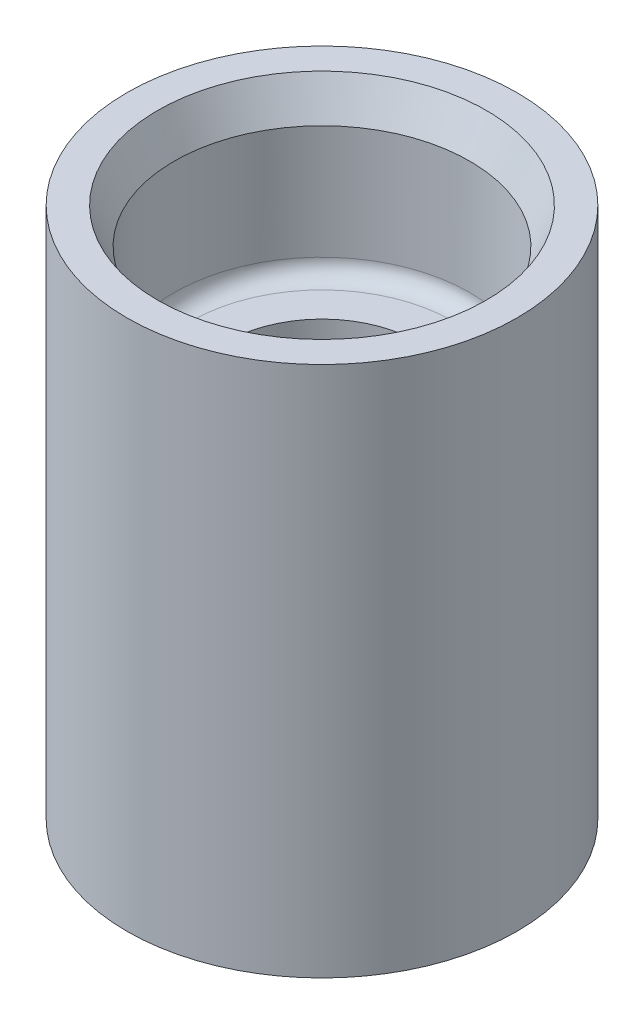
ISO-10303-21;
HEADER;
FILE_DESCRIPTION(('STEP AP214'),'2;1');
FILE_NAME('part.step','',(''),(''),'','','');
FILE_SCHEMA(('AUTOMOTIVE_DESIGN { 1 0 10303 214 1 1 1 1 }'));
ENDSEC;
DATA;
#1=APPLICATION_CONTEXT('core data for automotive mechanical design processes');
#2=APPLICATION_PROTOCOL_DEFINITION('international standard','automotive_design',2000,#1);
#3=PRODUCT_CONTEXT('',#1,'mechanical');
#4=PRODUCT('Part','Part','',(#3));
#5=PRODUCT_RELATED_PRODUCT_CATEGORY('part','',(#4));
#6=PRODUCT_DEFINITION_FORMATION('','',#4);
#7=PRODUCT_DEFINITION_CONTEXT('part definition',#1,'design');
#8=PRODUCT_DEFINITION('design','',#6,#7);
#9=PRODUCT_DEFINITION_SHAPE('','',#8);
#10=(LENGTH_UNIT() NAMED_UNIT(*) SI_UNIT(.MILLI.,.METRE.));
#11=(NAMED_UNIT(*) PLANE_ANGLE_UNIT() SI_UNIT($,.RADIAN.));
#12=(NAMED_UNIT(*) SI_UNIT($,.STERADIAN.) SOLID_ANGLE_UNIT());
#13=UNCERTAINTY_MEASURE_WITH_UNIT(LENGTH_MEASURE(1.E-05),#10,'distance_accuracy_value','');
#14=(GEOMETRIC_REPRESENTATION_CONTEXT(3) GLOBAL_UNCERTAINTY_ASSIGNED_CONTEXT((#13)) GLOBAL_UNIT_ASSIGNED_CONTEXT((#10,
#11,#12)) REPRESENTATION_CONTEXT('',''));
#15=CARTESIAN_POINT('',(0.,0.,0.));
#16=DIRECTION('',(0.,0.,1.));
#17=DIRECTION('',(1.,0.,0.));
#18=AXIS2_PLACEMENT_3D('',#15,#16,#17);
#19=CARTESIAN_POINT('',(9.75,27.2500002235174,0.));
#20=DIRECTION('',(0.,1.,0.));
#21=DIRECTION('',(-1.,0.,0.));
#22=AXIS2_PLACEMENT_3D('',#19,#20,#21);
#23=CYLINDRICAL_SURFACE('',#22,8.8999999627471);
#24=DIRECTION('',(0.,-1.,0.));
#25=VECTOR('',#24,1.);
#26=CARTESIAN_POINT('',(18.6499999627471,27.2500002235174,0.));
#27=LINE('',#26,#25);
#28=CARTESIAN_POINT('',(18.6499999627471,29.8554933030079,0.));
#29=VERTEX_POINT('',#28);
#30=CARTESIAN_POINT('',(18.6499999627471,23.0000002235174,0.));
#31=VERTEX_POINT('',#30);
#32=EDGE_CURVE('E130',#29,#31,#27,.T.);
#33=ORIENTED_EDGE('',*,*,#32,.F.);
#34=CARTESIAN_POINT('',(9.75,29.8554933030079,0.));
#35=DIRECTION('',(0.,1.,0.));
#36=DIRECTION('',(0.,0.,1.));
#37=AXIS2_PLACEMENT_3D('',#34,#35,#36);
#38=CIRCLE('',#37,8.8999999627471);
#39=EDGE_CURVE('E55',#29,#29,#38,.T.);
#40=ORIENTED_EDGE('',*,*,#39,.T.);
#41=ORIENTED_EDGE('',*,*,#32,.T.);
#42=CARTESIAN_POINT('',(9.75,23.0000002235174,0.));
#43=DIRECTION('',(0.,1.,0.));
#44=DIRECTION('',(1.,0.,0.));
#45=AXIS2_PLACEMENT_3D('',#42,#43,#44);
#46=CIRCLE('',#45,8.8999999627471);
#47=CARTESIAN_POINT('',(9.75,23.0000002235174,-8.8999999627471));
#48=VERTEX_POINT('',#47);
#49=EDGE_CURVE('E133',#48,#31,#46,.T.);
#50=ORIENTED_EDGE('',*,*,#49,.F.);
#51=CARTESIAN_POINT('',(9.75,23.0000002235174,0.));
#52=DIRECTION('',(0.,1.,0.));
#53=DIRECTION('',(1.,0.,0.));
#54=AXIS2_PLACEMENT_3D('',#51,#52,#53);
#55=CIRCLE('',#54,8.8999999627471);
#56=EDGE_CURVE('E137',#31,#48,#55,.T.);
#57=ORIENTED_EDGE('',*,*,#56,.F.);
#58=EDGE_LOOP('',(#33,#40,#41,#50,#57));
#59=FACE_BOUND('',#58,.T.);
#60=ADVANCED_FACE('F45',(#59),#23,.F.);
#61=CARTESIAN_POINT('',(0.350000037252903,32.0000002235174,0.));
#62=DIRECTION('',(0.,1.,0.));
#63=DIRECTION('',(1.,0.,0.));
#64=AXIS2_PLACEMENT_3D('',#61,#62,#63);
#65=PLANE('',#64);
#66=CARTESIAN_POINT('',(9.75,32.0000002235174,0.));
#67=DIRECTION('',(0.,1.,0.));
#68=DIRECTION('',(0.,0.,1.));
#69=AXIS2_PLACEMENT_3D('',#66,#67,#68);
#70=CIRCLE('',#69,9.8999999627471);
#71=CARTESIAN_POINT('',(9.75,32.0000002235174,9.8999999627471));
#72=VERTEX_POINT('',#71);
#73=EDGE_CURVE('E11',#72,#72,#70,.F.);
#74=ORIENTED_EDGE('',*,*,#73,.T.);
#75=EDGE_LOOP('',(#74));
#76=FACE_BOUND('',#75,.T.);
#77=CARTESIAN_POINT('',(9.75,32.0000002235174,0.));
#78=DIRECTION('',(0.,1.,0.));
#79=DIRECTION('',(1.,0.,0.));
#80=AXIS2_PLACEMENT_3D('',#77,#78,#79);
#81=CIRCLE('',#80,11.75);
#82=CARTESIAN_POINT('',(21.5,32.0000002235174,0.));
#83=VERTEX_POINT('',#82);
#84=EDGE_CURVE('E159',#83,#83,#81,.T.);
#85=ORIENTED_EDGE('',*,*,#84,.T.);
#86=EDGE_LOOP('',(#85));
#87=FACE_BOUND('',#86,.T.);
#88=ADVANCED_FACE('F291',(#76,#87),#65,.T.);
#89=CARTESIAN_POINT('',(9.75,16.0000001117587,0.));
#90=DIRECTION('',(0.,1.,0.));
#91=DIRECTION('',(-1.,0.,0.));
#92=AXIS2_PLACEMENT_3D('',#89,#90,#91);
#93=CYLINDRICAL_SURFACE('',#92,11.75);
#94=ORIENTED_EDGE('',*,*,#84,.F.);
#95=DIRECTION('',(0.,-1.,0.));
#96=VECTOR('',#95,1.);
#97=CARTESIAN_POINT('',(21.5,16.0000001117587,0.));
#98=LINE('',#97,#96);
#99=CARTESIAN_POINT('',(21.5,0.,0.));
#100=VERTEX_POINT('',#99);
#101=EDGE_CURVE('E71',#83,#100,#98,.T.);
#102=ORIENTED_EDGE('',*,*,#101,.T.);
#103=CARTESIAN_POINT('',(9.75,0.,0.));
#104=DIRECTION('',(0.,1.,0.));
#105=DIRECTION('',(1.,0.,0.));
#106=AXIS2_PLACEMENT_3D('',#103,#104,#105);
#107=CIRCLE('',#106,11.75);
#108=EDGE_CURVE('E165',#100,#100,#107,.T.);
#109=ORIENTED_EDGE('',*,*,#108,.T.);
#110=ORIENTED_EDGE('',*,*,#101,.F.);
#111=EDGE_LOOP('',(#94,#102,#109,#110));
#112=FACE_BOUND('',#111,.T.);
#113=ADVANCED_FACE('F286',(#112),#93,.T.);
#114=CARTESIAN_POINT('',(-2.,0.,0.));
#115=DIRECTION('',(0.,-1.,0.));
#116=DIRECTION('',(0.,0.,-1.));
#117=AXIS2_PLACEMENT_3D('',#114,#115,#116);
#118=PLANE('',#117);
#119=CARTESIAN_POINT('',(9.75,0.,0.));
#120=DIRECTION('',(0.,1.,0.));
#121=DIRECTION('',(1.,0.,0.));
#122=AXIS2_PLACEMENT_3D('',#119,#120,#121);
#123=CIRCLE('',#122,9.75);
#124=CARTESIAN_POINT('',(19.5,0.,0.));
#125=VERTEX_POINT('',#124);
#126=EDGE_CURVE('E171',#125,#125,#123,.T.);
#127=ORIENTED_EDGE('',*,*,#126,.T.);
#128=EDGE_LOOP('',(#127));
#129=FACE_BOUND('',#128,.T.);
#130=ORIENTED_EDGE('',*,*,#108,.F.);
#131=EDGE_LOOP('',(#130));
#132=FACE_BOUND('',#131,.T.);
#133=ADVANCED_FACE('F290',(#129,#132),#118,.T.);
#134=CARTESIAN_POINT('',(9.75,7.50000011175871,0.));
#135=DIRECTION('',(0.,1.,0.));
#136=DIRECTION('',(-1.,0.,0.));
#137=AXIS2_PLACEMENT_3D('',#134,#135,#136);
#138=CYLINDRICAL_SURFACE('',#137,9.75);
#139=CARTESIAN_POINT('',(9.75,15.0000002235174,0.));
#140=DIRECTION('',(0.,1.,0.));
#141=DIRECTION('',(1.,0.,0.));
#142=AXIS2_PLACEMENT_3D('',#139,#140,#141);
#143=CIRCLE('',#142,9.75);
#144=CARTESIAN_POINT('',(19.5,15.0000002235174,0.));
#145=VERTEX_POINT('',#144);
#146=EDGE_CURVE('E183',#145,#145,#143,.T.);
#147=ORIENTED_EDGE('',*,*,#146,.T.);
#148=DIRECTION('',(0.,-1.,0.));
#149=VECTOR('',#148,1.);
#150=CARTESIAN_POINT('',(19.5,7.50000011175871,0.));
#151=LINE('',#150,#149);
#152=EDGE_CURVE('E177',#145,#125,#151,.T.);
#153=ORIENTED_EDGE('',*,*,#152,.T.);
#154=ORIENTED_EDGE('',*,*,#126,.F.);
#155=ORIENTED_EDGE('',*,*,#152,.F.);
#156=EDGE_LOOP('',(#147,#153,#154,#155));
#157=FACE_BOUND('',#156,.T.);
#158=ADVANCED_FACE('F299',(#157),#138,.F.);
#159=CARTESIAN_POINT('',(0.,15.0000002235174,0.));
#160=DIRECTION('',(0.,-1.,0.));
#161=DIRECTION('',(0.,0.,-1.));
#162=AXIS2_PLACEMENT_3D('',#159,#160,#161);
#163=PLANE('',#162);
#164=CARTESIAN_POINT('',(9.75,15.0000002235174,0.));
#165=DIRECTION('',(0.,1.,0.));
#166=DIRECTION('',(1.,0.,0.));
#167=AXIS2_PLACEMENT_3D('',#164,#165,#166);
#168=CIRCLE('',#167,6.75);
#169=CARTESIAN_POINT('',(16.5,15.0000002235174,0.));
#170=VERTEX_POINT('',#169);
#171=EDGE_CURVE('E195',#170,#170,#168,.T.);
#172=ORIENTED_EDGE('',*,*,#171,.T.);
#173=EDGE_LOOP('',(#172));
#174=FACE_BOUND('',#173,.T.);
#175=ORIENTED_EDGE('',*,*,#146,.F.);
#176=EDGE_LOOP('',(#175));
#177=FACE_BOUND('',#176,.T.);
#178=ADVANCED_FACE('F363',(#174,#177),#163,.T.);
#179=CARTESIAN_POINT('',(9.75,13.0000001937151,0.));
#180=DIRECTION('',(0.,1.,0.));
#181=DIRECTION('',(-1.,0.,0.));
#182=AXIS2_PLACEMENT_3D('',#179,#180,#181);
#183=CYLINDRICAL_SURFACE('',#182,6.75);
#184=ORIENTED_EDGE('',*,*,#171,.F.);
#185=DIRECTION('',(0.,-1.,0.));
#186=VECTOR('',#185,1.);
#187=CARTESIAN_POINT('',(16.5,13.0000001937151,0.));
#188=LINE('',#187,#186);
#189=CARTESIAN_POINT('',(16.5,11.0000001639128,0.));
#190=VERTEX_POINT('',#189);
#191=EDGE_CURVE('E189',#170,#190,#188,.T.);
#192=ORIENTED_EDGE('',*,*,#191,.T.);
#193=CARTESIAN_POINT('',(9.75,11.0000001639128,0.));
#194=DIRECTION('',(0.,1.,0.));
#195=DIRECTION('',(1.,0.,0.));
#196=AXIS2_PLACEMENT_3D('',#193,#194,#195);
#197=CIRCLE('',#196,6.75);
#198=EDGE_CURVE('E203',#190,#190,#197,.T.);
#199=ORIENTED_EDGE('',*,*,#198,.T.);
#200=ORIENTED_EDGE('',*,*,#191,.F.);
#201=EDGE_LOOP('',(#184,#192,#199,#200));
#202=FACE_BOUND('',#201,.T.);
#203=ADVANCED_FACE('F319',(#202),#183,.T.);
#204=CARTESIAN_POINT('',(3.,11.0000001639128,0.));
#205=DIRECTION('',(0.,1.,0.));
#206=DIRECTION('',(1.,0.,0.));
#207=AXIS2_PLACEMENT_3D('',#204,#205,#206);
#208=PLANE('',#207);
#209=ORIENTED_EDGE('',*,*,#198,.F.);
#210=EDGE_LOOP('',(#209));
#211=FACE_BOUND('',#210,.T.);
#212=CARTESIAN_POINT('',(9.75,11.0000001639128,0.));
#213=DIRECTION('',(0.,1.,0.));
#214=DIRECTION('',(1.,0.,0.));
#215=AXIS2_PLACEMENT_3D('',#212,#213,#214);
#216=CIRCLE('',#215,7.74999997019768);
#217=CARTESIAN_POINT('',(17.4999999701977,11.0000001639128,0.));
#218=VERTEX_POINT('',#217);
#219=EDGE_CURVE('E215',#218,#218,#216,.T.);
#220=ORIENTED_EDGE('',*,*,#219,.T.);
#221=EDGE_LOOP('',(#220));
#222=FACE_BOUND('',#221,.T.);
#223=ADVANCED_FACE('F315',(#211,#222),#208,.T.);
#224=CARTESIAN_POINT('',(9.75,9.00000013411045,0.));
#225=DIRECTION('',(0.,1.,0.));
#226=DIRECTION('',(-1.,0.,0.));
#227=AXIS2_PLACEMENT_3D('',#224,#225,#226);
#228=CONICAL_SURFACE('',#227,7.24999998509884,0.244978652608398);
#229=ORIENTED_EDGE('',*,*,#219,.F.);
#230=DIRECTION('',(-0.242535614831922,-0.970142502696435,0.));
#231=VECTOR('',#230,1.);
#232=CARTESIAN_POINT('',(16.9999999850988,9.00000013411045,0.));
#233=LINE('',#232,#231);
#234=CARTESIAN_POINT('',(16.5,7.00000010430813,0.));
#235=VERTEX_POINT('',#234);
#236=EDGE_CURVE('E209',#218,#235,#233,.T.);
#237=ORIENTED_EDGE('',*,*,#236,.T.);
#238=CARTESIAN_POINT('',(9.75,7.00000010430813,0.));
#239=DIRECTION('',(0.,1.,0.));
#240=DIRECTION('',(1.,0.,0.));
#241=AXIS2_PLACEMENT_3D('',#238,#239,#240);
#242=CIRCLE('',#241,6.75);
#243=EDGE_CURVE('E226',#235,#235,#242,.T.);
#244=ORIENTED_EDGE('',*,*,#243,.T.);
#245=ORIENTED_EDGE('',*,*,#236,.F.);
#246=EDGE_LOOP('',(#229,#237,#244,#245));
#247=FACE_BOUND('',#246,.T.);
#248=ADVANCED_FACE('F280',(#247),#228,.T.);
#249=CARTESIAN_POINT('',(9.75,5.50000008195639,0.));
#250=DIRECTION('',(0.,1.,0.));
#251=DIRECTION('',(-1.,0.,0.));
#252=AXIS2_PLACEMENT_3D('',#249,#250,#251);
#253=CYLINDRICAL_SURFACE('',#252,6.75);
#254=ORIENTED_EDGE('',*,*,#243,.F.);
#255=DIRECTION('',(0.,-1.,0.));
#256=VECTOR('',#255,1.);
#257=CARTESIAN_POINT('',(16.5,5.50000008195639,0.));
#258=LINE('',#257,#256);
#259=CARTESIAN_POINT('',(16.5,4.00000005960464,0.));
#260=VERTEX_POINT('',#259);
#261=EDGE_CURVE('E222',#235,#260,#258,.T.);
#262=ORIENTED_EDGE('',*,*,#261,.T.);
#263=CARTESIAN_POINT('',(9.75,4.00000005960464,0.));
#264=DIRECTION('',(0.,1.,0.));
#265=DIRECTION('',(1.,0.,0.));
#266=AXIS2_PLACEMENT_3D('',#263,#264,#265);
#267=CIRCLE('',#266,6.75);
#268=EDGE_CURVE('E231',#260,#260,#267,.T.);
#269=ORIENTED_EDGE('',*,*,#268,.T.);
#270=ORIENTED_EDGE('',*,*,#261,.F.);
#271=EDGE_LOOP('',(#254,#262,#269,#270));
#272=FACE_BOUND('',#271,.T.);
#273=ADVANCED_FACE('F274',(#272),#253,.T.);
#274=CARTESIAN_POINT('',(3.,4.00000005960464,0.));
#275=DIRECTION('',(0.,1.,0.));
#276=DIRECTION('',(1.,0.,0.));
#277=AXIS2_PLACEMENT_3D('',#274,#275,#276);
#278=PLANE('',#277);
#279=ORIENTED_EDGE('',*,*,#268,.F.);
#280=EDGE_LOOP('',(#279));
#281=FACE_BOUND('',#280,.T.);
#282=CARTESIAN_POINT('',(9.75,4.00000005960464,0.));
#283=DIRECTION('',(0.,1.,0.));
#284=DIRECTION('',(1.,0.,0.));
#285=AXIS2_PLACEMENT_3D('',#282,#283,#284);
#286=CIRCLE('',#285,7.74999997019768);
#287=CARTESIAN_POINT('',(17.4999999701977,4.00000005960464,0.));
#288=VERTEX_POINT('',#287);
#289=EDGE_CURVE('E240',#288,#288,#286,.T.);
#290=ORIENTED_EDGE('',*,*,#289,.T.);
#291=EDGE_LOOP('',(#290));
#292=FACE_BOUND('',#291,.T.);
#293=ADVANCED_FACE('F279',(#281,#292),#278,.T.);
#294=CARTESIAN_POINT('',(9.75,2.00000002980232,0.));
#295=DIRECTION('',(0.,1.,0.));
#296=DIRECTION('',(-1.,0.,0.));
#297=AXIS2_PLACEMENT_3D('',#294,#295,#296);
#298=CONICAL_SURFACE('',#297,7.24999998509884,0.244978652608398);
#299=ORIENTED_EDGE('',*,*,#289,.F.);
#300=DIRECTION('',(-0.242535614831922,-0.970142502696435,0.));
#301=VECTOR('',#300,1.);
#302=CARTESIAN_POINT('',(16.9999999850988,2.00000002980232,0.));
#303=LINE('',#302,#301);
#304=CARTESIAN_POINT('',(16.5,0.,0.));
#305=VERTEX_POINT('',#304);
#306=EDGE_CURVE('E236',#288,#305,#303,.T.);
#307=ORIENTED_EDGE('',*,*,#306,.T.);
#308=CARTESIAN_POINT('',(9.75,0.,0.));
#309=DIRECTION('',(0.,1.,0.));
#310=DIRECTION('',(1.,0.,0.));
#311=AXIS2_PLACEMENT_3D('',#308,#309,#310);
#312=CIRCLE('',#311,6.75);
#313=EDGE_CURVE('E245',#305,#305,#312,.T.);
#314=ORIENTED_EDGE('',*,*,#313,.T.);
#315=ORIENTED_EDGE('',*,*,#306,.F.);
#316=EDGE_LOOP('',(#299,#307,#314,#315));
#317=FACE_BOUND('',#316,.T.);
#318=ADVANCED_FACE('F305',(#317),#298,.T.);
#319=CARTESIAN_POINT('',(3.,0.,0.));
#320=DIRECTION('',(0.,-1.,0.));
#321=DIRECTION('',(0.,0.,-1.));
#322=AXIS2_PLACEMENT_3D('',#319,#320,#321);
#323=PLANE('',#322);
#324=CARTESIAN_POINT('',(9.75,0.,0.));
#325=DIRECTION('',(0.,1.,0.));
#326=DIRECTION('',(1.,0.,0.));
#327=AXIS2_PLACEMENT_3D('',#324,#325,#326);
#328=CIRCLE('',#327,5.74999994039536);
#329=CARTESIAN_POINT('',(15.4999999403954,0.,0.));
#330=VERTEX_POINT('',#329);
#331=EDGE_CURVE('E250',#330,#330,#328,.T.);
#332=ORIENTED_EDGE('',*,*,#331,.T.);
#333=EDGE_LOOP('',(#332));
#334=FACE_BOUND('',#333,.T.);
#335=ORIENTED_EDGE('',*,*,#313,.F.);
#336=EDGE_LOOP('',(#335));
#337=FACE_BOUND('',#336,.T.);
#338=ADVANCED_FACE('F309',(#334,#337),#323,.T.);
#339=CARTESIAN_POINT('',(9.75,7.64510865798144,0.));
#340=DIRECTION('',(0.,1.,0.));
#341=DIRECTION('',(-1.,0.,0.));
#342=AXIS2_PLACEMENT_3D('',#339,#340,#341);
#343=CYLINDRICAL_SURFACE('',#342,5.74999994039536);
#344=CARTESIAN_POINT('',(9.75,22.0000002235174,0.));
#345=DIRECTION('',(0.,1.,0.));
#346=DIRECTION('',(1.,0.,0.));
#347=AXIS2_PLACEMENT_3D('',#344,#345,#346);
#348=CIRCLE('',#347,5.7499999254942);
#349=CARTESIAN_POINT('',(15.4999999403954,22.0000002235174,0.));
#350=VERTEX_POINT('',#349);
#351=EDGE_CURVE('E261',#350,#350,#348,.T.);
#352=ORIENTED_EDGE('',*,*,#351,.T.);
#353=DIRECTION('',(0.,-1.,0.));
#354=VECTOR('',#353,1.);
#355=CARTESIAN_POINT('',(15.4999999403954,7.64510865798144,0.));
#356=LINE('',#355,#354);
#357=EDGE_CURVE('E255',#350,#330,#356,.T.);
#358=ORIENTED_EDGE('',*,*,#357,.T.);
#359=ORIENTED_EDGE('',*,*,#331,.F.);
#360=ORIENTED_EDGE('',*,*,#357,.F.);
#361=EDGE_LOOP('',(#352,#358,#359,#360));
#362=FACE_BOUND('',#361,.T.);
#363=ADVANCED_FACE('F338',(#362),#343,.F.);
#364=CARTESIAN_POINT('',(4.00000007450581,22.0000002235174,0.));
#365=DIRECTION('',(0.,1.,0.));
#366=DIRECTION('',(1.,0.,0.));
#367=AXIS2_PLACEMENT_3D('',#364,#365,#366);
#368=PLANE('',#367);
#369=ORIENTED_EDGE('',*,*,#351,.F.);
#370=EDGE_LOOP('',(#369));
#371=FACE_BOUND('',#370,.T.);
#372=CARTESIAN_POINT('',(9.75,22.0000002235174,0.));
#373=DIRECTION('',(0.,1.,0.));
#374=DIRECTION('',(1.,0.,0.));
#375=AXIS2_PLACEMENT_3D('',#372,#373,#374);
#376=CIRCLE('',#375,7.8999999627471);
#377=CARTESIAN_POINT('',(9.75,22.0000002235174,-7.8999999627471));
#378=VERTEX_POINT('',#377);
#379=EDGE_CURVE('E150',#378,#378,#376,.T.);
#380=ORIENTED_EDGE('',*,*,#379,.T.);
#381=EDGE_LOOP('',(#380));
#382=FACE_BOUND('',#381,.T.);
#383=ADVANCED_FACE('F355',(#371,#382),#368,.T.);
#384=CARTESIAN_POINT('',(9.75,23.0000002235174,0.));
#385=DIRECTION('',(0.,1.,0.));
#386=DIRECTION('',(0.,0.,1.));
#387=AXIS2_PLACEMENT_3D('',#384,#385,#386);
#388=TOROIDAL_SURFACE('',#387,7.89999996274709,1.);
#389=ORIENTED_EDGE('',*,*,#49,.T.);
#390=ORIENTED_EDGE('',*,*,#56,.T.);
#391=CARTESIAN_POINT('',(9.75,23.0000002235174,-7.89999996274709));
#392=DIRECTION('',(-1.,0.,0.));
#393=DIRECTION('',(0.,0.,-1.));
#394=AXIS2_PLACEMENT_3D('',#391,#392,#393);
#395=CIRCLE('',#394,1.);
#396=EDGE_CURVE('E141',#48,#378,#395,.T.);
#397=ORIENTED_EDGE('',*,*,#396,.T.);
#398=ORIENTED_EDGE('',*,*,#379,.F.);
#399=ORIENTED_EDGE('',*,*,#396,.F.);
#400=EDGE_LOOP('',(#389,#390,#397,#398,#399));
#401=FACE_BOUND('',#400,.T.);
#402=ADVANCED_FACE('F143',(#401),#388,.F.);
#403=CARTESIAN_POINT('',(9.75,29.8554933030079,0.));
#404=DIRECTION('',(0.,1.,0.));
#405=DIRECTION('',(0.,0.,1.));
#406=AXIS2_PLACEMENT_3D('',#403,#404,#405);
#407=CONICAL_SURFACE('',#406,8.8999999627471,0.436332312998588);
#408=ORIENTED_EDGE('',*,*,#73,.F.);
#409=EDGE_LOOP('',(#408));
#410=FACE_BOUND('',#409,.T.);
#411=ORIENTED_EDGE('',*,*,#39,.F.);
#412=EDGE_LOOP('',(#411));
#413=FACE_BOUND('',#412,.T.);
#414=ADVANCED_FACE('F48',(#410,#413),#407,.F.);
#415=CLOSED_SHELL('',(#60,#88,#113,#133,#158,#178,#203,#223,#248,#273,#293,#318,#338,#363,#383,
#402,#414));
#416=MANIFOLD_SOLID_BREP('B2',#415);
#417=ADVANCED_BREP_SHAPE_REPRESENTATION('',(#18,#416),#14);
#418=SHAPE_DEFINITION_REPRESENTATION(#9,#417);
ENDSEC;
END-ISO-10303-21;
